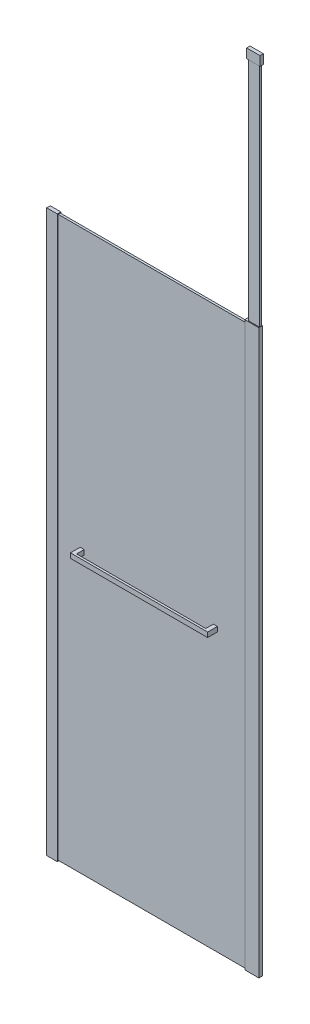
from build123d import *

# Parameters (mm, degrees)
DODANIE_WYCI_GNI_CIE1_START         = 3
DODANIE_WYCI_GNI_CIE1_DEPTH         = 2100
SZKIC2_W                            = 747
SZKIC2_H                            = 8
DODANIE_WYCI_GNI_CIE2_DEPTH         = 2100
DODANIE_WYCI_GNI_CIE3_DEPTH         = 2108
SZKIC4_W                            = 40
SZKIC4_H                            = 13.3
DODANIE_WYCI_GNI_CIE4_DEPTH         = 3
SZKIC5_W                            = 53
SZKIC5_H                            = 14
DODANIE_WYCI_GNI_CIE5_DEPTH         = 3
SZKIC6_W                            = 8.1
SZKIC6_H                            = 7.8
DODANIE_WYCI_GNI_CIE6_DEPTH         = 15
SZKIC7_W                            = 53
SZKIC7_H                            = 14
DODANIE_WYCI_GNI_CIE7_DEPTH         = 3
SZKIC8_W                            = 40
SZKIC8_H                            = 13.3
DODANIE_WYCI_GNI_CIE8_DEPTH         = 3
SZKIC9_W                            = 40
SZKIC9_H                            = 8
DODANIE_WYCI_GNI_CIE9_DEPTH         = 883
DODANIE_WYCI_GNI_CIE10_START        = -32
SZKIC10_W                           = 50
SZKIC10_H                           = 12.5
DODANIE_WYCI_GNI_CIE10_DEPTH        = 35
DODANIE_WYCI_GNI_CIE11_DEPTH        = 36.5
DODANIE_WYCI_GNI_CIE11_DEPTH_BACK   = 18
SZKIC12_W                           = 15
SZKIC12_H                           = 18
DODANIE_WYCI_GNI_CIE11_2_DEPTH      = 36.5
DODANIE_WYCI_GNI_CIE11_2_DEPTH_BACK = 18
SZKIC13_W                           = 8
SZKIC13_H                           = 18
DODANIE_WYCI_GNI_CIE12_DEPTH        = 485


with BuildPart() as part:
    # Szkic1 → Dodanie-wyci_gni_cie1 (new body)
    with BuildSketch(Plane(origin=(0, 0, 0), x_dir=(1, 0, 0), z_dir=(0, 1, 0)).offset(DODANIE_WYCI_GNI_CIE1_START)):
        Polygon((0, 0), (0, 13.3), (40, 13.3), (40, 11.4), (6.5, 11.4), (6.5, 3.4), (40, 3.4), (40, 0), align=None)
    extrude(amount=DODANIE_WYCI_GNI_CIE1_DEPTH)

    # Szkic4 → Dodanie-wyci_gni_cie4 (add)
    with BuildSketch(Plane(origin=(0, 2103, 0), x_dir=(1, 0, 0), z_dir=(0, 1, 0))):
        with Locations((20, 6.65)):
            Rectangle(SZKIC4_W, SZKIC4_H)
    extrude(amount=DODANIE_WYCI_GNI_CIE4_DEPTH)

    # Szkic8 → Dodanie-wyci_gni_cie8 (add)
    with BuildSketch(Plane.XZ.offset(-3)):
        with Locations((20, -6.65)):
            Rectangle(SZKIC8_W, SZKIC8_H)
    extrude(amount=DODANIE_WYCI_GNI_CIE8_DEPTH)


with BuildPart() as body_2:
    # Szkic2 → Dodanie-wyci_gni_cie2 (new body)
    with BuildSketch(Plane.XZ.offset(-3)):
        with Locations((380, -7.4)):
            Rectangle(SZKIC2_W, SZKIC2_H)
    extrude(amount=-DODANIE_WYCI_GNI_CIE2_DEPTH)


with BuildPart() as body_3:
    # Szkic3 → Dodanie-wyci_gni_cie3 (new body)
    with BuildSketch(Plane.XZ.offset(-3)):
        Polygon((743.4, -3.4), (743.4, -0.4), (796.4, -0.4), (796.4, -14.4), (743.4, -14.4), (743.4, -11.4), (753.5, -11.4), (753.5, -3.4), align=None)
    extrude(amount=-DODANIE_WYCI_GNI_CIE3_DEPTH)

    # Szkic5 → Dodanie-wyci_gni_cie5 (add)
    with BuildSketch(Plane(origin=(0, 2111, 0), x_dir=(1, 0, 0), z_dir=(0, 1, 0))):
        with Locations((769.9, 7.4)):
            Rectangle(SZKIC5_W, SZKIC5_H)
    extrude(amount=DODANIE_WYCI_GNI_CIE5_DEPTH)

    # Szkic6 → Dodanie-wyci_gni_cie6 (add)
    with BuildSketch(Plane.ZY.offset(-743.4)):
        with Locations((-7.4, 2107.1)):
            Rectangle(SZKIC6_W, SZKIC6_H)
    extrude(amount=-DODANIE_WYCI_GNI_CIE6_DEPTH)

    # Szkic7 → Dodanie-wyci_gni_cie7 (add)
    with BuildSketch(Plane.XZ.offset(-3)):
        with Locations((769.9, -7.4)):
            Rectangle(SZKIC7_W, SZKIC7_H)
    extrude(amount=DODANIE_WYCI_GNI_CIE7_DEPTH)


with BuildPart() as body_4:
    # Szkic9 → Dodanie-wyci_gni_cie9 (new body)
    with BuildSketch(Plane(origin=(0, 2114, 2099.6), x_dir=(-1, 0, 0), z_dir=(0, -1, 0))):
        with Locations((-774.9, 2107)):
            Rectangle(SZKIC9_W, SZKIC9_H)
    extrude(amount=-DODANIE_WYCI_GNI_CIE9_DEPTH)

    # Szkic10 → Dodanie-wyci_gni_cie10 (add)
    with BuildSketch(Plane(origin=(0, 2997, 0), x_dir=(-1, 0, 0), z_dir=(0, 1, 0)).offset(DODANIE_WYCI_GNI_CIE10_START)):
        with Locations((-774.9, -7.4)):
            Rectangle(SZKIC10_W, SZKIC10_H)
    extrude(amount=DODANIE_WYCI_GNI_CIE10_DEPTH)


with BuildPart() as body_5:
    # Szkic12 → Dodanie-wyci_gni_cie11 (new, two sides: drawn at the far end of the back side and taken through both)
    with BuildSketch(Plane.XY.offset(-3.4).offset(-DODANIE_WYCI_GNI_CIE11_DEPTH_BACK)):
        with Locations((130, 1053)):
            Rectangle(SZKIC12_W, SZKIC12_H)
    extrude(amount=DODANIE_WYCI_GNI_CIE11_DEPTH + DODANIE_WYCI_GNI_CIE11_DEPTH_BACK)



with BuildPart() as body_6:
    # Szkic12 → Dodanie-wyci_gni_cie11 2 (new, two sides: drawn at the far end of the back side and taken through both)
    with BuildSketch(Plane.XY.offset(-3.4).offset(-DODANIE_WYCI_GNI_CIE11_2_DEPTH_BACK)):
        with Locations((630, 1053)):
            Rectangle(SZKIC12_W, SZKIC12_H)
    extrude(amount=DODANIE_WYCI_GNI_CIE11_2_DEPTH + DODANIE_WYCI_GNI_CIE11_2_DEPTH_BACK)


with BuildPart() as body_5_1:
    add(body_5.part)

    add(body_6.part)  # Dodanie-wyci_gni_cie12 merges body 6
    # Szkic13 → Dodanie-wyci_gni_cie12 (add)
    with BuildSketch(Plane(origin=(137.5, 0, 0), x_dir=(0, 0, -1), z_dir=(1, 0, 0))):
        with Locations((-29.1, 1053)):
            Rectangle(SZKIC13_W, SZKIC13_H)
    extrude(amount=DODANIE_WYCI_GNI_CIE12_DEPTH)


solid = Compound([part.part, body_2.part, body_3.part, body_4.part, body_5_1.part])
